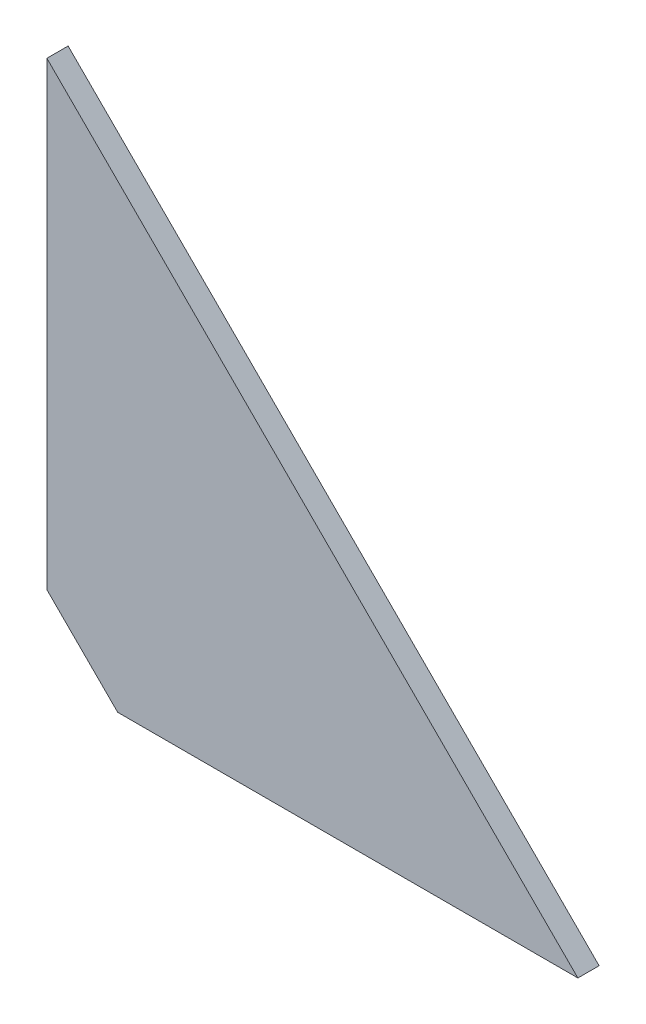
ISO-10303-21;
HEADER;
FILE_DESCRIPTION(('STEP AP214'),'2;1');
FILE_NAME('part.step','',(''),(''),'','','');
FILE_SCHEMA(('AUTOMOTIVE_DESIGN { 1 0 10303 214 1 1 1 1 }'));
ENDSEC;
DATA;
#1=APPLICATION_CONTEXT('core data for automotive mechanical design processes');
#2=APPLICATION_PROTOCOL_DEFINITION('international standard','automotive_design',2000,#1);
#3=PRODUCT_CONTEXT('',#1,'mechanical');
#4=PRODUCT('Part','Part','',(#3));
#5=PRODUCT_RELATED_PRODUCT_CATEGORY('part','',(#4));
#6=PRODUCT_DEFINITION_FORMATION('','',#4);
#7=PRODUCT_DEFINITION_CONTEXT('part definition',#1,'design');
#8=PRODUCT_DEFINITION('design','',#6,#7);
#9=PRODUCT_DEFINITION_SHAPE('','',#8);
#10=(LENGTH_UNIT() NAMED_UNIT(*) SI_UNIT(.MILLI.,.METRE.));
#11=(NAMED_UNIT(*) PLANE_ANGLE_UNIT() SI_UNIT($,.RADIAN.));
#12=(NAMED_UNIT(*) SI_UNIT($,.STERADIAN.) SOLID_ANGLE_UNIT());
#13=UNCERTAINTY_MEASURE_WITH_UNIT(LENGTH_MEASURE(1.E-05),#10,'distance_accuracy_value','');
#14=(GEOMETRIC_REPRESENTATION_CONTEXT(3) GLOBAL_UNCERTAINTY_ASSIGNED_CONTEXT((#13)) GLOBAL_UNIT_ASSIGNED_CONTEXT((#10,
#11,#12)) REPRESENTATION_CONTEXT('',''));
#15=CARTESIAN_POINT('',(0.,0.,0.));
#16=DIRECTION('',(0.,0.,1.));
#17=DIRECTION('',(1.,0.,0.));
#18=AXIS2_PLACEMENT_3D('',#15,#16,#17);
#19=CARTESIAN_POINT('',(26.5165042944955,26.5165042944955,3.));
#20=DIRECTION('',(0.,0.,1.));
#21=DIRECTION('',(1.,0.,0.));
#22=AXIS2_PLACEMENT_3D('',#19,#20,#21);
#23=PLANE('',#22);
#24=DIRECTION('',(-0.707106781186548,0.707106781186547,0.));
#25=VECTOR('',#24,1.);
#26=CARTESIAN_POINT('',(75.,0.,3.));
#27=LINE('',#26,#25);
#28=CARTESIAN_POINT('',(0.,75.,3.));
#29=VERTEX_POINT('',#28);
#30=CARTESIAN_POINT('',(75.,0.,3.));
#31=VERTEX_POINT('',#30);
#32=EDGE_CURVE('E58',#29,#31,#27,.F.);
#33=ORIENTED_EDGE('',*,*,#32,.F.);
#34=DIRECTION('',(0.,1.,0.));
#35=VECTOR('',#34,1.);
#36=CARTESIAN_POINT('',(0.,75.,3.));
#37=LINE('',#36,#35);
#38=CARTESIAN_POINT('',(0.,10.,3.));
#39=VERTEX_POINT('',#38);
#40=EDGE_CURVE('E53',#39,#29,#37,.T.);
#41=ORIENTED_EDGE('',*,*,#40,.F.);
#42=DIRECTION('',(0.707106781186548,-0.707106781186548,0.));
#43=VECTOR('',#42,1.);
#44=CARTESIAN_POINT('',(5.,5.,3.));
#45=LINE('',#44,#43);
#46=CARTESIAN_POINT('',(10.,0.,3.));
#47=VERTEX_POINT('',#46);
#48=EDGE_CURVE('E68',#47,#39,#45,.F.);
#49=ORIENTED_EDGE('',*,*,#48,.F.);
#50=DIRECTION('',(1.,0.,0.));
#51=VECTOR('',#50,1.);
#52=CARTESIAN_POINT('',(0.,0.,3.));
#53=LINE('',#52,#51);
#54=EDGE_CURVE('E20',#31,#47,#53,.F.);
#55=ORIENTED_EDGE('',*,*,#54,.F.);
#56=EDGE_LOOP('',(#33,#41,#49,#55));
#57=FACE_BOUND('',#56,.T.);
#58=ADVANCED_FACE('F17',(#57),#23,.T.);
#59=CARTESIAN_POINT('',(0.,0.,0.));
#60=DIRECTION('',(0.,-1.,0.));
#61=DIRECTION('',(0.,0.,-1.));
#62=AXIS2_PLACEMENT_3D('',#59,#60,#61);
#63=PLANE('',#62);
#64=DIRECTION('',(0.,0.,1.));
#65=VECTOR('',#64,1.);
#66=CARTESIAN_POINT('',(75.,0.,0.));
#67=LINE('',#66,#65);
#68=CARTESIAN_POINT('',(75.,0.,0.));
#69=VERTEX_POINT('',#68);
#70=EDGE_CURVE('E63',#31,#69,#67,.F.);
#71=ORIENTED_EDGE('',*,*,#70,.F.);
#72=ORIENTED_EDGE('',*,*,#54,.T.);
#73=DIRECTION('',(0.,0.,1.));
#74=VECTOR('',#73,1.);
#75=CARTESIAN_POINT('',(10.,0.,0.));
#76=LINE('',#75,#74);
#77=CARTESIAN_POINT('',(10.,0.,0.));
#78=VERTEX_POINT('',#77);
#79=EDGE_CURVE('E81',#78,#47,#76,.T.);
#80=ORIENTED_EDGE('',*,*,#79,.F.);
#81=DIRECTION('',(1.,0.,0.));
#82=VECTOR('',#81,1.);
#83=CARTESIAN_POINT('',(26.5165042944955,0.,0.));
#84=LINE('',#83,#82);
#85=EDGE_CURVE('E74',#78,#69,#84,.T.);
#86=ORIENTED_EDGE('',*,*,#85,.T.);
#87=EDGE_LOOP('',(#71,#72,#80,#86));
#88=FACE_BOUND('',#87,.T.);
#89=ADVANCED_FACE('F73',(#88),#63,.T.);
#90=CARTESIAN_POINT('',(75.,0.,0.));
#91=DIRECTION('',(0.707106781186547,0.707106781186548,0.));
#92=DIRECTION('',(-0.707106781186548,0.707106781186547,0.));
#93=AXIS2_PLACEMENT_3D('',#90,#91,#92);
#94=PLANE('',#93);
#95=ORIENTED_EDGE('',*,*,#32,.T.);
#96=ORIENTED_EDGE('',*,*,#70,.T.);
#97=DIRECTION('',(-0.707106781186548,0.707106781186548,0.));
#98=VECTOR('',#97,1.);
#99=CARTESIAN_POINT('',(75.,0.,0.));
#100=LINE('',#99,#98);
#101=CARTESIAN_POINT('',(0.,75.,0.));
#102=VERTEX_POINT('',#101);
#103=EDGE_CURVE('E84',#69,#102,#100,.T.);
#104=ORIENTED_EDGE('',*,*,#103,.T.);
#105=DIRECTION('',(0.,0.,1.));
#106=VECTOR('',#105,1.);
#107=CARTESIAN_POINT('',(0.,75.,0.));
#108=LINE('',#107,#106);
#109=EDGE_CURVE('E65',#29,#102,#108,.F.);
#110=ORIENTED_EDGE('',*,*,#109,.F.);
#111=EDGE_LOOP('',(#95,#96,#104,#110));
#112=FACE_BOUND('',#111,.T.);
#113=ADVANCED_FACE('F60',(#112),#94,.T.);
#114=CARTESIAN_POINT('',(0.,75.,0.));
#115=DIRECTION('',(-1.,0.,0.));
#116=DIRECTION('',(0.,0.,1.));
#117=AXIS2_PLACEMENT_3D('',#114,#115,#116);
#118=PLANE('',#117);
#119=ORIENTED_EDGE('',*,*,#109,.T.);
#120=DIRECTION('',(0.,1.,0.));
#121=VECTOR('',#120,1.);
#122=CARTESIAN_POINT('',(0.,26.5165042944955,0.));
#123=LINE('',#122,#121);
#124=CARTESIAN_POINT('',(0.,10.,0.));
#125=VERTEX_POINT('',#124);
#126=EDGE_CURVE('E26',#102,#125,#123,.F.);
#127=ORIENTED_EDGE('',*,*,#126,.T.);
#128=DIRECTION('',(0.,0.,1.));
#129=VECTOR('',#128,1.);
#130=CARTESIAN_POINT('',(0.,10.,0.));
#131=LINE('',#130,#129);
#132=EDGE_CURVE('E34',#39,#125,#131,.F.);
#133=ORIENTED_EDGE('',*,*,#132,.F.);
#134=ORIENTED_EDGE('',*,*,#40,.T.);
#135=EDGE_LOOP('',(#119,#127,#133,#134));
#136=FACE_BOUND('',#135,.T.);
#137=ADVANCED_FACE('F88',(#136),#118,.T.);
#138=CARTESIAN_POINT('',(5.,5.,0.));
#139=DIRECTION('',(-0.707106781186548,-0.707106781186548,0.));
#140=DIRECTION('',(0.707106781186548,-0.707106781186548,0.));
#141=AXIS2_PLACEMENT_3D('',#138,#139,#140);
#142=PLANE('',#141);
#143=DIRECTION('',(0.707106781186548,-0.707106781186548,0.));
#144=VECTOR('',#143,1.);
#145=CARTESIAN_POINT('',(0.,10.,0.));
#146=LINE('',#145,#144);
#147=EDGE_CURVE('E11',#125,#78,#146,.T.);
#148=ORIENTED_EDGE('',*,*,#147,.T.);
#149=ORIENTED_EDGE('',*,*,#79,.T.);
#150=ORIENTED_EDGE('',*,*,#48,.T.);
#151=ORIENTED_EDGE('',*,*,#132,.T.);
#152=EDGE_LOOP('',(#148,#149,#150,#151));
#153=FACE_BOUND('',#152,.T.);
#154=ADVANCED_FACE('F91',(#153),#142,.T.);
#155=CARTESIAN_POINT('',(26.5165042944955,26.5165042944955,0.));
#156=DIRECTION('',(0.,0.,1.));
#157=DIRECTION('',(1.,0.,0.));
#158=AXIS2_PLACEMENT_3D('',#155,#156,#157);
#159=PLANE('',#158);
#160=ORIENTED_EDGE('',*,*,#126,.F.);
#161=ORIENTED_EDGE('',*,*,#103,.F.);
#162=ORIENTED_EDGE('',*,*,#85,.F.);
#163=ORIENTED_EDGE('',*,*,#147,.F.);
#164=EDGE_LOOP('',(#160,#161,#162,#163));
#165=FACE_BOUND('',#164,.T.);
#166=ADVANCED_FACE('F90',(#165),#159,.F.);
#167=CLOSED_SHELL('',(#58,#89,#113,#137,#154,#166));
#168=MANIFOLD_SOLID_BREP('B1',#167);
#169=ADVANCED_BREP_SHAPE_REPRESENTATION('',(#18,#168),#14);
#170=SHAPE_DEFINITION_REPRESENTATION(#9,#169);
ENDSEC;
END-ISO-10303-21;
